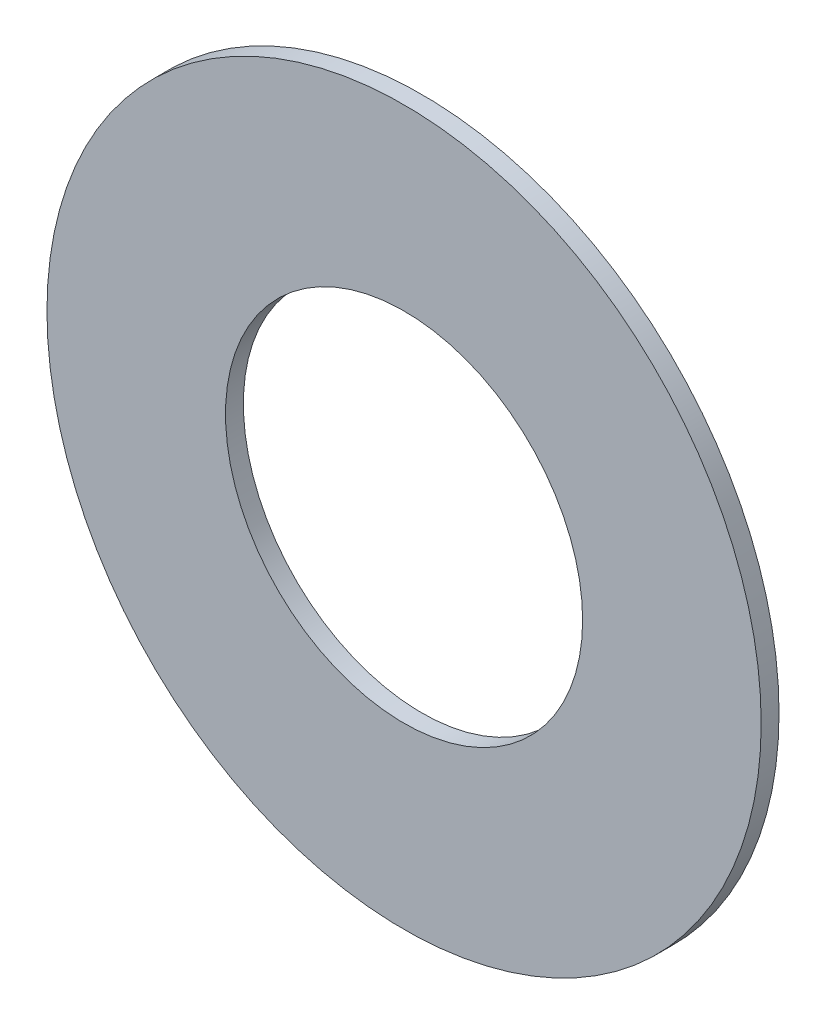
from build123d import *

# Parameters (mm, degrees)
ESQUISSE1_R          = 10
ESQUISSE1_R_2        = 5
BASE_EXTRUSION_DEPTH = 0.25


with BuildPart() as part:
    # Esquisse1 → Base-Extrusion (new, symmetric)
    with BuildSketch(Plane.XY):
        Circle(ESQUISSE1_R)
        Circle(ESQUISSE1_R_2, mode=Mode.SUBTRACT)
    extrude(amount=BASE_EXTRUSION_DEPTH, both=True)


solid = part.part
